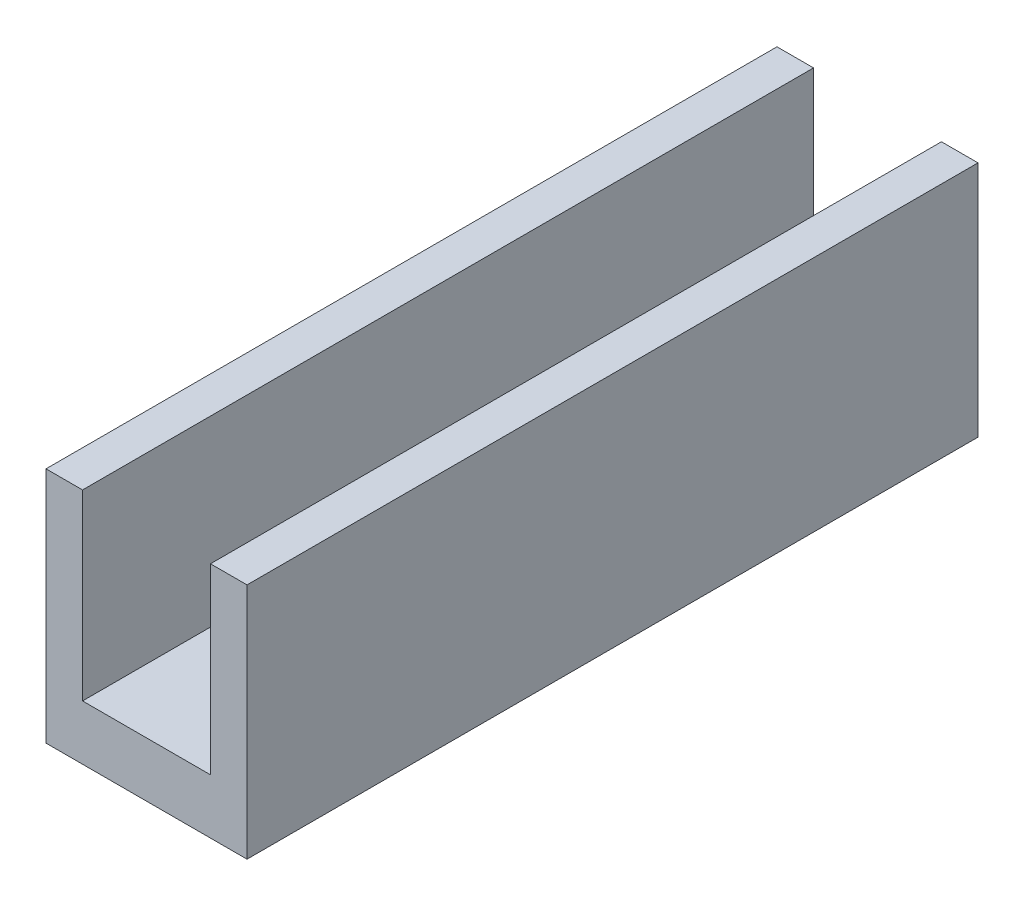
from build123d import *

# Parameters (mm, degrees)
BOSS_EXTRUDE1_DEPTH = 80


with BuildPart() as part:
    # Sketch1 → Boss-Extrude1 (new body)
    with BuildSketch(Plane.XY):
        Polygon((7, 20), (7, 0), (-7, 0), (-7, 20), (-11, 20), (-11, -6), (11, -6), (11, 20), align=None)
    extrude(amount=BOSS_EXTRUDE1_DEPTH)


solid = part.part
